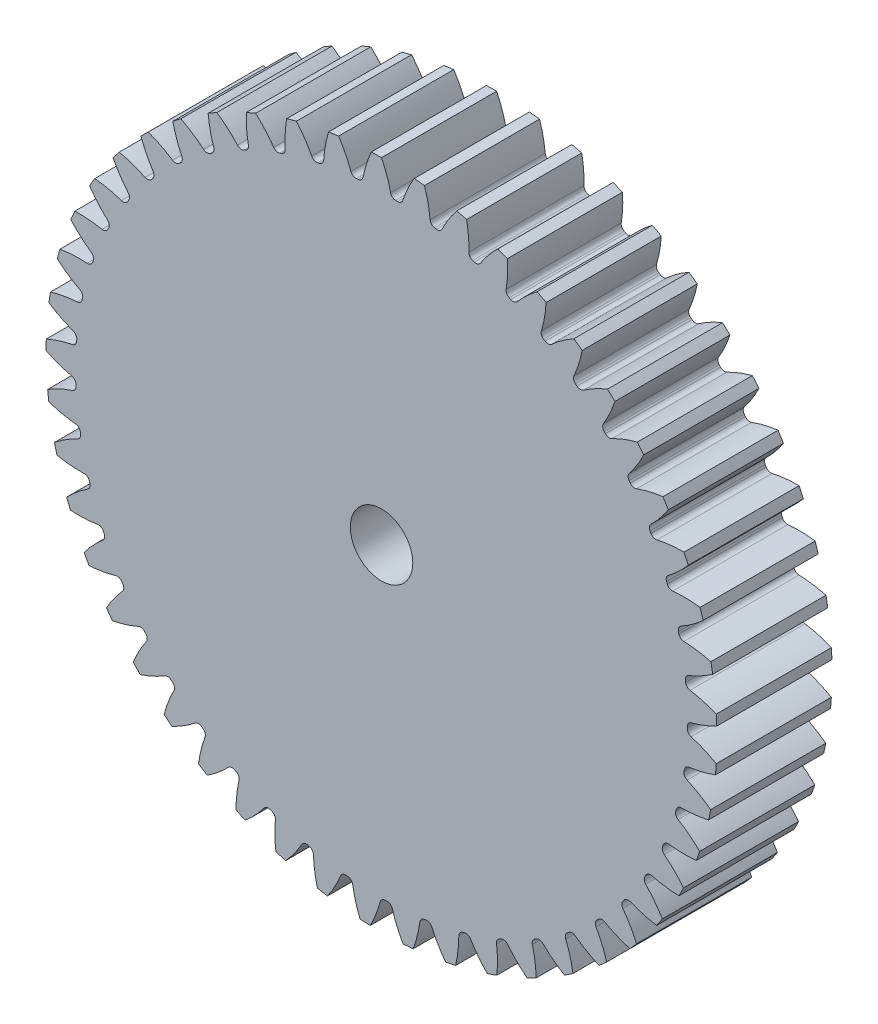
from build123d import *

# Parameters (mm, degrees)
SKETCH3_R         = 259.08
GEARBODY_DEPTH    = 88.9
TOOTHCUT_DEPTH    = 378.025334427
CIRPATTERN1_COUNT = 49
BOREDIA_R         = 24.13
BORE_DEPTH        = 12700


with BuildPart() as part:
    # Sketch3 → gearBody (new body)
    with BuildSketch(Plane.XY):
        Circle(SKETCH3_R)
    extrude(amount=GEARBODY_DEPTH)

    # Sketch2 → toothCut (cut, through all)
    with BuildSketch(Plane.XY):
        with BuildLine():
            ThreePointArc((236.173429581, -4.690368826), (236.186500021, -3.978141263), (236.197422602, -3.265877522))
            ThreePointArc((236.197422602, -3.265877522), (237.077295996, -0.77252644), (239.287908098, 0.67804963))
            ThreePointArc((239.287908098, 0.67804963), (249.407489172, 3.956002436), (259.08, 8.382449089))
            ThreePointArc((259.08, 8.382449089), (259.178809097, -4.365405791), (258.650747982, -17.102702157))
            ThreePointArc((258.650747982, -17.102702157), (249.132792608, -12.353026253), (239.129342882, -8.736136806))
            ThreePointArc((239.129342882, -8.736136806), (236.968835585, -7.211937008), (236.173429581, -4.690368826))
        make_face()
    toothcut = extrude(amount=TOOTHCUT_DEPTH, mode=Mode.SUBTRACT)

    # CirPattern1: toothCut ×49 about axis
    cirpattern1_axis = Axis((0, 0, 0), (0, 0, 1))
    for i in range(1, CIRPATTERN1_COUNT):
        add(toothcut.rotate(cirpattern1_axis, i * 360 / CIRPATTERN1_COUNT), mode=Mode.SUBTRACT)

    # boreDia → bore (cut, symmetric)
    with BuildSketch(Plane.XY):
        Circle(BOREDIA_R)
    extrude(amount=BORE_DEPTH, both=True, mode=Mode.SUBTRACT)


solid = part.part
